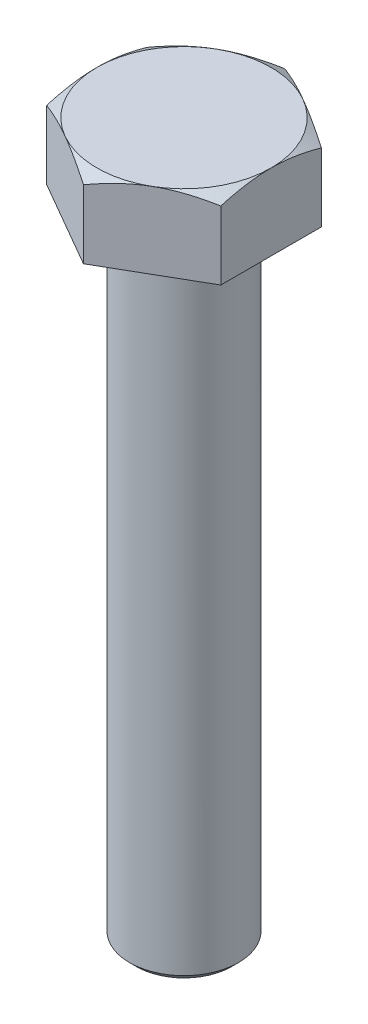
from build123d import *

# Parameters (mm, degrees)
BOSS_EXTRUDE1_DEPTH = 8.4
SKETCH2_R           = 6
BOSS_EXTRUDE2_DEPTH = 70
SKETCH3_OUTSIDE_W   = 280.428
SKETCH3_OUTSIDE_H   = 283.398
SKETCH3_OUTSIDE_R   = 9.6
CUT_EXTRUDE1_DEPTH  = 70
CUT_EXTRUDE1_DRAFT  = -60
SKETCH4_OUTSIDE_W   = 57.942
SKETCH4_OUTSIDE_H   = 60.912
SKETCH4_OUTSIDE_R   = 5.25
CUT_EXTRUDE2_DEPTH  = 10
CUT_EXTRUDE2_DRAFT  = -45


with BuildPart() as part:
    # Sketch1 → Boss-Extrude1 (new body)
    with BuildSketch(Plane(origin=(0, 0, 0), x_dir=(1, 0, 0), z_dir=(0, 1, 0))):
        Polygon((0, 11.085125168), (-9.6, 5.542562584), (-9.6, -5.542562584), (0, -11.085125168), (9.6, -5.542562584), (9.6, 5.542562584), align=None)
    extrude(amount=BOSS_EXTRUDE1_DEPTH)

    # Sketch2 → Boss-Extrude2 (add)
    with BuildSketch(Plane(origin=(0, 0, 0), x_dir=(-1, 0, 0), z_dir=(0, -1, 0))):
        with Locations(Location((0, 0, 0), (0, 0, 270))):
            Circle(SKETCH2_R)
    extrude(amount=BOSS_EXTRUDE2_DEPTH)


with BuildPart() as cut_extrude1_tool:
    # Sketch3 outside → Cut-Extrude1 (with draft: the straight prism first)
    with BuildSketch(Plane(origin=(0, 8.4, 0), x_dir=(1, 0, 0), z_dir=(0, 1, 0))):
        Rectangle(SKETCH3_OUTSIDE_W, SKETCH3_OUTSIDE_H)
        Circle(SKETCH3_OUTSIDE_R, mode=Mode.SUBTRACT)
    extrude(amount=-CUT_EXTRUDE1_DEPTH)
    # Cut-Extrude1: the draft: its side faces are tilted about the plane it starts from
    cut_extrude1_sides = [cut_extrude1_tool.faces().sort_by_distance(p)[0] for p in [
        (0, -26.6, 141.699),
        (140.214, -26.6, 0),
        (0, -26.6, -141.699),
        (-140.214, -26.6, 0),
        (-9.6, -26.6, 0),
    ]]
    draft(cut_extrude1_sides, Plane(origin=(0, 8.4, 0), x_dir=(1, 0, 0), z_dir=(0, 1, 0)), CUT_EXTRUDE1_DRAFT)


with BuildPart() as part_1:
    add(part.part)

    # Cut-Extrude1: cut by cut_extrude1_tool
    add(cut_extrude1_tool.part, mode=Mode.SUBTRACT)


with BuildPart() as cut_extrude2_tool:
    # Sketch4 outside → Cut-Extrude2 (with draft: the straight prism first)
    with BuildSketch(Plane(origin=(0, -70, 0), x_dir=(-1, 0, 0), z_dir=(0, -1, 0))):
        Rectangle(SKETCH4_OUTSIDE_W, SKETCH4_OUTSIDE_H)
        Circle(SKETCH4_OUTSIDE_R, mode=Mode.SUBTRACT)
    extrude(amount=-CUT_EXTRUDE2_DEPTH)
    # Cut-Extrude2: the draft: its side faces are tilted about the plane it starts from
    cut_extrude2_sides = [cut_extrude2_tool.faces().sort_by_distance(p)[0] for p in [
        (0, -65, 30.456),
        (-28.971, -65, 0),
        (0, -65, -30.456),
        (28.971, -65, 0),
        (5.25, -65, 0),
    ]]
    draft(cut_extrude2_sides, Plane(origin=(0, -70, 0), x_dir=(-1, 0, 0), z_dir=(0, -1, 0)), CUT_EXTRUDE2_DRAFT)


with BuildPart() as part_2:
    add(part_1.part)

    # Cut-Extrude2: cut by cut_extrude2_tool
    add(cut_extrude2_tool.part, mode=Mode.SUBTRACT)


solid = part_2.part
